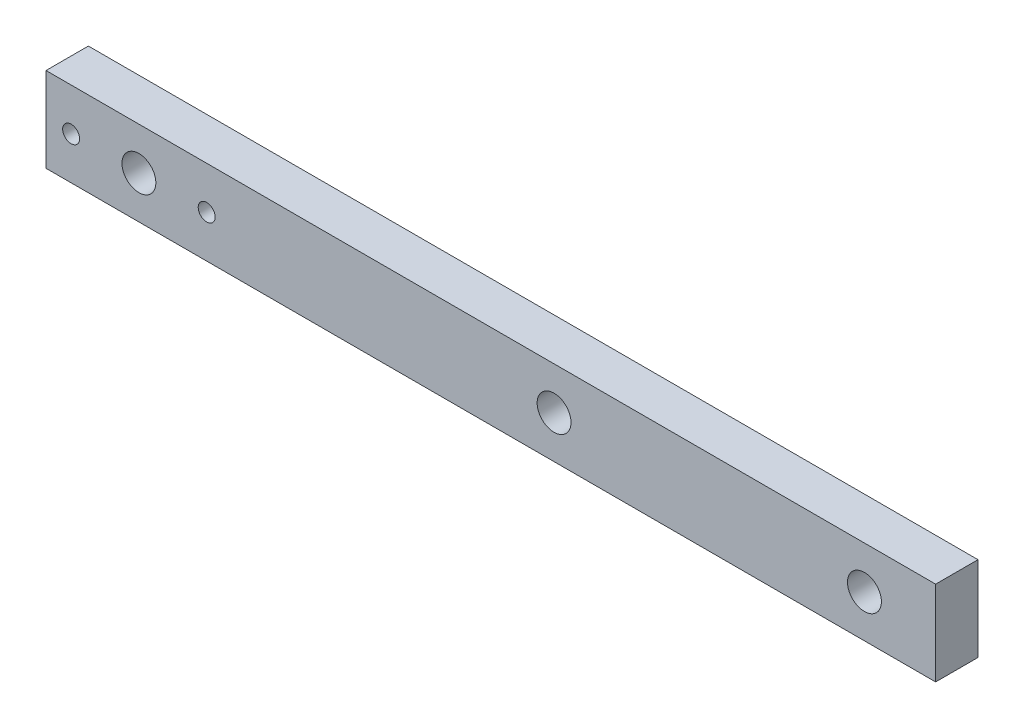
ISO-10303-21;
HEADER;
FILE_DESCRIPTION(('STEP AP214'),'2;1');
FILE_NAME('part.step','',(''),(''),'','','');
FILE_SCHEMA(('AUTOMOTIVE_DESIGN { 1 0 10303 214 1 1 1 1 }'));
ENDSEC;
DATA;
#1=APPLICATION_CONTEXT('core data for automotive mechanical design processes');
#2=APPLICATION_PROTOCOL_DEFINITION('international standard','automotive_design',2000,#1);
#3=PRODUCT_CONTEXT('',#1,'mechanical');
#4=PRODUCT('Part','Part','',(#3));
#5=PRODUCT_RELATED_PRODUCT_CATEGORY('part','',(#4));
#6=PRODUCT_DEFINITION_FORMATION('','',#4);
#7=PRODUCT_DEFINITION_CONTEXT('part definition',#1,'design');
#8=PRODUCT_DEFINITION('design','',#6,#7);
#9=PRODUCT_DEFINITION_SHAPE('','',#8);
#10=(LENGTH_UNIT() NAMED_UNIT(*) SI_UNIT(.MILLI.,.METRE.));
#11=(NAMED_UNIT(*) PLANE_ANGLE_UNIT() SI_UNIT($,.RADIAN.));
#12=(NAMED_UNIT(*) SI_UNIT($,.STERADIAN.) SOLID_ANGLE_UNIT());
#13=UNCERTAINTY_MEASURE_WITH_UNIT(LENGTH_MEASURE(1.E-05),#10,'distance_accuracy_value','');
#14=(GEOMETRIC_REPRESENTATION_CONTEXT(3) GLOBAL_UNCERTAINTY_ASSIGNED_CONTEXT((#13)) GLOBAL_UNIT_ASSIGNED_CONTEXT((#10,
#11,#12)) REPRESENTATION_CONTEXT('',''));
#15=CARTESIAN_POINT('',(0.,0.,0.));
#16=DIRECTION('',(0.,0.,1.));
#17=DIRECTION('',(1.,0.,0.));
#18=AXIS2_PLACEMENT_3D('',#15,#16,#17);
#19=CARTESIAN_POINT('',(-55.,5.,5.));
#20=DIRECTION('',(1.,0.,0.));
#21=DIRECTION('',(0.,0.,-1.));
#22=AXIS2_PLACEMENT_3D('',#19,#20,#21);
#23=PLANE('',#22);
#24=DIRECTION('',(0.,-1.,0.));
#25=VECTOR('',#24,1.);
#26=CARTESIAN_POINT('',(-55.,5.,0.));
#27=LINE('',#26,#25);
#28=CARTESIAN_POINT('',(-55.,5.,0.));
#29=VERTEX_POINT('',#28);
#30=CARTESIAN_POINT('',(-55.,-5.,0.));
#31=VERTEX_POINT('',#30);
#32=EDGE_CURVE('E100',#29,#31,#27,.T.);
#33=ORIENTED_EDGE('',*,*,#32,.T.);
#34=DIRECTION('',(0.,0.,-1.));
#35=VECTOR('',#34,1.);
#36=CARTESIAN_POINT('',(-55.,-5.,5.));
#37=LINE('',#36,#35);
#38=CARTESIAN_POINT('',(-55.,-5.,5.));
#39=VERTEX_POINT('',#38);
#40=EDGE_CURVE('E11',#39,#31,#37,.T.);
#41=ORIENTED_EDGE('',*,*,#40,.F.);
#42=DIRECTION('',(0.,-1.,0.));
#43=VECTOR('',#42,1.);
#44=CARTESIAN_POINT('',(-55.,5.,5.));
#45=LINE('',#44,#43);
#46=CARTESIAN_POINT('',(-55.,5.,5.));
#47=VERTEX_POINT('',#46);
#48=EDGE_CURVE('E88',#47,#39,#45,.T.);
#49=ORIENTED_EDGE('',*,*,#48,.F.);
#50=DIRECTION('',(0.,0.,-1.));
#51=VECTOR('',#50,1.);
#52=CARTESIAN_POINT('',(-55.,5.,5.));
#53=LINE('',#52,#51);
#54=EDGE_CURVE('E96',#47,#29,#53,.T.);
#55=ORIENTED_EDGE('',*,*,#54,.T.);
#56=EDGE_LOOP('',(#33,#41,#49,#55));
#57=FACE_BOUND('',#56,.T.);
#58=ADVANCED_FACE('F37',(#57),#23,.F.);
#59=CARTESIAN_POINT('',(-55.,-5.,5.));
#60=DIRECTION('',(0.,1.,0.));
#61=DIRECTION('',(0.,0.,1.));
#62=AXIS2_PLACEMENT_3D('',#59,#60,#61);
#63=PLANE('',#62);
#64=DIRECTION('',(1.,0.,0.));
#65=VECTOR('',#64,1.);
#66=CARTESIAN_POINT('',(-55.,-5.,0.));
#67=LINE('',#66,#65);
#68=CARTESIAN_POINT('',(50.,-5.,0.));
#69=VERTEX_POINT('',#68);
#70=EDGE_CURVE('E92',#31,#69,#67,.T.);
#71=ORIENTED_EDGE('',*,*,#70,.T.);
#72=DIRECTION('',(0.,0.,-1.));
#73=VECTOR('',#72,1.);
#74=CARTESIAN_POINT('',(50.,-5.,5.));
#75=LINE('',#74,#73);
#76=CARTESIAN_POINT('',(50.,-5.,5.));
#77=VERTEX_POINT('',#76);
#78=EDGE_CURVE('E45',#77,#69,#75,.T.);
#79=ORIENTED_EDGE('',*,*,#78,.F.);
#80=DIRECTION('',(1.,0.,0.));
#81=VECTOR('',#80,1.);
#82=CARTESIAN_POINT('',(-55.,-5.,5.));
#83=LINE('',#82,#81);
#84=EDGE_CURVE('E83',#39,#77,#83,.T.);
#85=ORIENTED_EDGE('',*,*,#84,.F.);
#86=ORIENTED_EDGE('',*,*,#40,.T.);
#87=EDGE_LOOP('',(#71,#79,#85,#86));
#88=FACE_BOUND('',#87,.T.);
#89=ADVANCED_FACE('F91',(#88),#63,.F.);
#90=CARTESIAN_POINT('',(50.,5.,5.));
#91=DIRECTION('',(-1.,0.,0.));
#92=DIRECTION('',(0.,-1.,0.));
#93=AXIS2_PLACEMENT_3D('',#90,#91,#92);
#94=PLANE('',#93);
#95=DIRECTION('',(0.,1.,0.));
#96=VECTOR('',#95,1.);
#97=CARTESIAN_POINT('',(50.,5.,0.));
#98=LINE('',#97,#96);
#99=CARTESIAN_POINT('',(50.,5.,0.));
#100=VERTEX_POINT('',#99);
#101=EDGE_CURVE('E70',#69,#100,#98,.T.);
#102=ORIENTED_EDGE('',*,*,#101,.T.);
#103=DIRECTION('',(0.,0.,-1.));
#104=VECTOR('',#103,1.);
#105=CARTESIAN_POINT('',(50.,5.,5.));
#106=LINE('',#105,#104);
#107=CARTESIAN_POINT('',(50.,5.,5.));
#108=VERTEX_POINT('',#107);
#109=EDGE_CURVE('E93',#108,#100,#106,.T.);
#110=ORIENTED_EDGE('',*,*,#109,.F.);
#111=DIRECTION('',(0.,1.,0.));
#112=VECTOR('',#111,1.);
#113=CARTESIAN_POINT('',(50.,5.,5.));
#114=LINE('',#113,#112);
#115=EDGE_CURVE('E86',#77,#108,#114,.T.);
#116=ORIENTED_EDGE('',*,*,#115,.F.);
#117=ORIENTED_EDGE('',*,*,#78,.T.);
#118=EDGE_LOOP('',(#102,#110,#116,#117));
#119=FACE_BOUND('',#118,.T.);
#120=ADVANCED_FACE('F94',(#119),#94,.F.);
#121=CARTESIAN_POINT('',(-55.,5.,5.));
#122=DIRECTION('',(0.,-1.,0.));
#123=DIRECTION('',(0.,0.,-1.));
#124=AXIS2_PLACEMENT_3D('',#121,#122,#123);
#125=PLANE('',#124);
#126=DIRECTION('',(-1.,0.,0.));
#127=VECTOR('',#126,1.);
#128=CARTESIAN_POINT('',(-55.,5.,0.));
#129=LINE('',#128,#127);
#130=EDGE_CURVE('E76',#100,#29,#129,.T.);
#131=ORIENTED_EDGE('',*,*,#130,.T.);
#132=ORIENTED_EDGE('',*,*,#54,.F.);
#133=DIRECTION('',(-1.,0.,0.));
#134=VECTOR('',#133,1.);
#135=CARTESIAN_POINT('',(-55.,5.,5.));
#136=LINE('',#135,#134);
#137=EDGE_CURVE('E53',#108,#47,#136,.T.);
#138=ORIENTED_EDGE('',*,*,#137,.F.);
#139=ORIENTED_EDGE('',*,*,#109,.T.);
#140=EDGE_LOOP('',(#131,#132,#138,#139));
#141=FACE_BOUND('',#140,.T.);
#142=ADVANCED_FACE('F108',(#141),#125,.F.);
#143=CARTESIAN_POINT('',(0.,0.,5.));
#144=DIRECTION('',(0.,0.,1.));
#145=DIRECTION('',(1.,0.,0.));
#146=AXIS2_PLACEMENT_3D('',#143,#144,#145);
#147=PLANE('',#146);
#148=CARTESIAN_POINT('',(4.9657,0.,5.));
#149=DIRECTION('',(0.,0.,1.));
#150=DIRECTION('',(1.,0.,0.));
#151=AXIS2_PLACEMENT_3D('',#148,#149,#150);
#152=CIRCLE('',#151,2.);
#153=CARTESIAN_POINT('',(6.9657,0.,5.));
#154=VERTEX_POINT('',#153);
#155=EDGE_CURVE('E138',#154,#154,#152,.T.);
#156=ORIENTED_EDGE('',*,*,#155,.F.);
#157=EDGE_LOOP('',(#156));
#158=FACE_BOUND('',#157,.T.);
#159=CARTESIAN_POINT('',(41.598396,0.,5.));
#160=DIRECTION('',(0.,0.,1.));
#161=DIRECTION('',(1.,0.,0.));
#162=AXIS2_PLACEMENT_3D('',#159,#160,#161);
#163=CIRCLE('',#162,2.);
#164=CARTESIAN_POINT('',(43.598396,0.,5.));
#165=VERTEX_POINT('',#164);
#166=EDGE_CURVE('E132',#165,#165,#163,.T.);
#167=ORIENTED_EDGE('',*,*,#166,.F.);
#168=EDGE_LOOP('',(#167));
#169=FACE_BOUND('',#168,.T.);
#170=CARTESIAN_POINT('',(-36.0343,0.,5.));
#171=DIRECTION('',(0.,0.,1.));
#172=DIRECTION('',(1.,0.,0.));
#173=AXIS2_PLACEMENT_3D('',#170,#171,#172);
#174=CIRCLE('',#173,0.999999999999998);
#175=CARTESIAN_POINT('',(-35.0343,0.,5.));
#176=VERTEX_POINT('',#175);
#177=EDGE_CURVE('E126',#176,#176,#174,.T.);
#178=ORIENTED_EDGE('',*,*,#177,.F.);
#179=EDGE_LOOP('',(#178));
#180=FACE_BOUND('',#179,.T.);
#181=CARTESIAN_POINT('',(-52.0343,0.,5.));
#182=DIRECTION('',(0.,0.,1.));
#183=DIRECTION('',(1.,0.,0.));
#184=AXIS2_PLACEMENT_3D('',#181,#182,#183);
#185=CIRCLE('',#184,0.999999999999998);
#186=CARTESIAN_POINT('',(-51.0343,0.,5.));
#187=VERTEX_POINT('',#186);
#188=EDGE_CURVE('E120',#187,#187,#185,.T.);
#189=ORIENTED_EDGE('',*,*,#188,.F.);
#190=EDGE_LOOP('',(#189));
#191=FACE_BOUND('',#190,.T.);
#192=CARTESIAN_POINT('',(-44.0343,0.,5.));
#193=DIRECTION('',(0.,0.,1.));
#194=DIRECTION('',(1.,0.,0.));
#195=AXIS2_PLACEMENT_3D('',#192,#193,#194);
#196=CIRCLE('',#195,2.);
#197=CARTESIAN_POINT('',(-42.0343,0.,5.));
#198=VERTEX_POINT('',#197);
#199=EDGE_CURVE('E114',#198,#198,#196,.T.);
#200=ORIENTED_EDGE('',*,*,#199,.F.);
#201=EDGE_LOOP('',(#200));
#202=FACE_BOUND('',#201,.T.);
#203=ORIENTED_EDGE('',*,*,#48,.T.);
#204=ORIENTED_EDGE('',*,*,#84,.T.);
#205=ORIENTED_EDGE('',*,*,#115,.T.);
#206=ORIENTED_EDGE('',*,*,#137,.T.);
#207=EDGE_LOOP('',(#203,#204,#205,#206));
#208=FACE_BOUND('',#207,.T.);
#209=ADVANCED_FACE('F84',(#158,#169,#180,#191,#202,#208),#147,.T.);
#210=CARTESIAN_POINT('',(0.,0.,0.));
#211=DIRECTION('',(0.,0.,1.));
#212=DIRECTION('',(1.,0.,0.));
#213=AXIS2_PLACEMENT_3D('',#210,#211,#212);
#214=PLANE('',#213);
#215=CARTESIAN_POINT('',(4.9657,0.,0.));
#216=DIRECTION('',(0.,0.,1.));
#217=DIRECTION('',(1.,0.,0.));
#218=AXIS2_PLACEMENT_3D('',#215,#216,#217);
#219=CIRCLE('',#218,2.);
#220=CARTESIAN_POINT('',(6.9657,0.,0.));
#221=VERTEX_POINT('',#220);
#222=EDGE_CURVE('E135',#221,#221,#219,.T.);
#223=ORIENTED_EDGE('',*,*,#222,.T.);
#224=EDGE_LOOP('',(#223));
#225=FACE_BOUND('',#224,.T.);
#226=CARTESIAN_POINT('',(41.598396,0.,0.));
#227=DIRECTION('',(0.,0.,1.));
#228=DIRECTION('',(1.,0.,0.));
#229=AXIS2_PLACEMENT_3D('',#226,#227,#228);
#230=CIRCLE('',#229,2.);
#231=CARTESIAN_POINT('',(43.598396,0.,0.));
#232=VERTEX_POINT('',#231);
#233=EDGE_CURVE('E129',#232,#232,#230,.T.);
#234=ORIENTED_EDGE('',*,*,#233,.T.);
#235=EDGE_LOOP('',(#234));
#236=FACE_BOUND('',#235,.T.);
#237=CARTESIAN_POINT('',(-36.0343,0.,0.));
#238=DIRECTION('',(0.,0.,1.));
#239=DIRECTION('',(1.,0.,0.));
#240=AXIS2_PLACEMENT_3D('',#237,#238,#239);
#241=CIRCLE('',#240,0.999999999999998);
#242=CARTESIAN_POINT('',(-35.0343,0.,0.));
#243=VERTEX_POINT('',#242);
#244=EDGE_CURVE('E123',#243,#243,#241,.T.);
#245=ORIENTED_EDGE('',*,*,#244,.T.);
#246=EDGE_LOOP('',(#245));
#247=FACE_BOUND('',#246,.T.);
#248=CARTESIAN_POINT('',(-52.0343,0.,0.));
#249=DIRECTION('',(0.,0.,1.));
#250=DIRECTION('',(1.,0.,0.));
#251=AXIS2_PLACEMENT_3D('',#248,#249,#250);
#252=CIRCLE('',#251,0.999999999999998);
#253=CARTESIAN_POINT('',(-51.0343,0.,0.));
#254=VERTEX_POINT('',#253);
#255=EDGE_CURVE('E117',#254,#254,#252,.T.);
#256=ORIENTED_EDGE('',*,*,#255,.T.);
#257=EDGE_LOOP('',(#256));
#258=FACE_BOUND('',#257,.T.);
#259=CARTESIAN_POINT('',(-44.0343,0.,0.));
#260=DIRECTION('',(0.,0.,1.));
#261=DIRECTION('',(1.,0.,0.));
#262=AXIS2_PLACEMENT_3D('',#259,#260,#261);
#263=CIRCLE('',#262,2.);
#264=CARTESIAN_POINT('',(-42.0343,0.,0.));
#265=VERTEX_POINT('',#264);
#266=EDGE_CURVE('E103',#265,#265,#263,.T.);
#267=ORIENTED_EDGE('',*,*,#266,.T.);
#268=EDGE_LOOP('',(#267));
#269=FACE_BOUND('',#268,.T.);
#270=ORIENTED_EDGE('',*,*,#32,.F.);
#271=ORIENTED_EDGE('',*,*,#130,.F.);
#272=ORIENTED_EDGE('',*,*,#101,.F.);
#273=ORIENTED_EDGE('',*,*,#70,.F.);
#274=EDGE_LOOP('',(#270,#271,#272,#273));
#275=FACE_BOUND('',#274,.T.);
#276=ADVANCED_FACE('F111',(#225,#236,#247,#258,#269,#275),#214,.F.);
#277=CARTESIAN_POINT('',(-44.0343,0.,0.));
#278=DIRECTION('',(0.,0.,1.));
#279=DIRECTION('',(1.,0.,0.));
#280=AXIS2_PLACEMENT_3D('',#277,#278,#279);
#281=CYLINDRICAL_SURFACE('',#280,2.);
#282=ORIENTED_EDGE('',*,*,#266,.F.);
#283=EDGE_LOOP('',(#282));
#284=FACE_BOUND('',#283,.T.);
#285=ORIENTED_EDGE('',*,*,#199,.T.);
#286=EDGE_LOOP('',(#285));
#287=FACE_BOUND('',#286,.T.);
#288=ADVANCED_FACE('F164',(#284,#287),#281,.F.);
#289=CARTESIAN_POINT('',(-52.0343,0.,0.));
#290=DIRECTION('',(0.,0.,1.));
#291=DIRECTION('',(1.,0.,0.));
#292=AXIS2_PLACEMENT_3D('',#289,#290,#291);
#293=CYLINDRICAL_SURFACE('',#292,0.999999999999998);
#294=ORIENTED_EDGE('',*,*,#255,.F.);
#295=EDGE_LOOP('',(#294));
#296=FACE_BOUND('',#295,.T.);
#297=ORIENTED_EDGE('',*,*,#188,.T.);
#298=EDGE_LOOP('',(#297));
#299=FACE_BOUND('',#298,.T.);
#300=ADVANCED_FACE('F166',(#296,#299),#293,.F.);
#301=CARTESIAN_POINT('',(-36.0343,0.,0.));
#302=DIRECTION('',(0.,0.,1.));
#303=DIRECTION('',(1.,0.,0.));
#304=AXIS2_PLACEMENT_3D('',#301,#302,#303);
#305=CYLINDRICAL_SURFACE('',#304,0.999999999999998);
#306=ORIENTED_EDGE('',*,*,#244,.F.);
#307=EDGE_LOOP('',(#306));
#308=FACE_BOUND('',#307,.T.);
#309=ORIENTED_EDGE('',*,*,#177,.T.);
#310=EDGE_LOOP('',(#309));
#311=FACE_BOUND('',#310,.T.);
#312=ADVANCED_FACE('F173',(#308,#311),#305,.F.);
#313=CARTESIAN_POINT('',(41.598396,0.,0.));
#314=DIRECTION('',(0.,0.,1.));
#315=DIRECTION('',(1.,0.,0.));
#316=AXIS2_PLACEMENT_3D('',#313,#314,#315);
#317=CYLINDRICAL_SURFACE('',#316,2.);
#318=ORIENTED_EDGE('',*,*,#233,.F.);
#319=EDGE_LOOP('',(#318));
#320=FACE_BOUND('',#319,.T.);
#321=ORIENTED_EDGE('',*,*,#166,.T.);
#322=EDGE_LOOP('',(#321));
#323=FACE_BOUND('',#322,.T.);
#324=ADVANCED_FACE('F149',(#320,#323),#317,.F.);
#325=CARTESIAN_POINT('',(4.9657,0.,0.));
#326=DIRECTION('',(0.,0.,1.));
#327=DIRECTION('',(1.,0.,0.));
#328=AXIS2_PLACEMENT_3D('',#325,#326,#327);
#329=CYLINDRICAL_SURFACE('',#328,2.);
#330=ORIENTED_EDGE('',*,*,#222,.F.);
#331=EDGE_LOOP('',(#330));
#332=FACE_BOUND('',#331,.T.);
#333=ORIENTED_EDGE('',*,*,#155,.T.);
#334=EDGE_LOOP('',(#333));
#335=FACE_BOUND('',#334,.T.);
#336=ADVANCED_FACE('F146',(#332,#335),#329,.F.);
#337=CLOSED_SHELL('',(#58,#89,#120,#142,#209,#276,#288,#300,#312,#324,#336));
#338=MANIFOLD_SOLID_BREP('B2',#337);
#339=ADVANCED_BREP_SHAPE_REPRESENTATION('',(#18,#338),#14);
#340=SHAPE_DEFINITION_REPRESENTATION(#9,#339);
ENDSEC;
END-ISO-10303-21;
